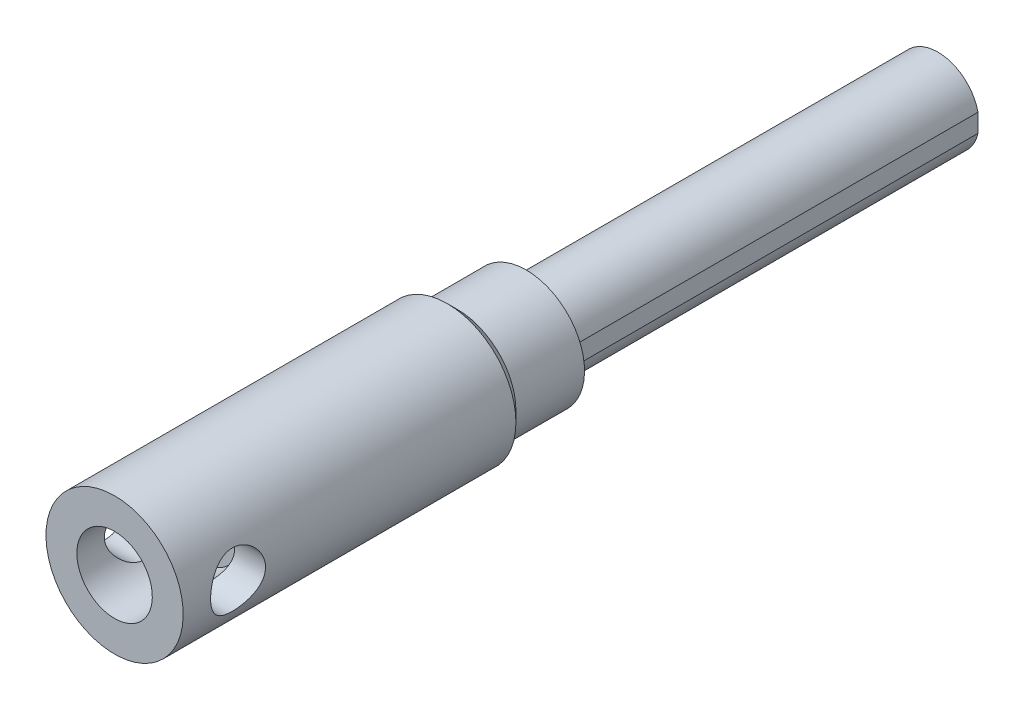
ISO-10303-21;
HEADER;
FILE_DESCRIPTION(('STEP AP214'),'2;1');
FILE_NAME('part.step','',(''),(''),'','','');
FILE_SCHEMA(('AUTOMOTIVE_DESIGN { 1 0 10303 214 1 1 1 1 }'));
ENDSEC;
DATA;
#1=APPLICATION_CONTEXT('core data for automotive mechanical design processes');
#2=APPLICATION_PROTOCOL_DEFINITION('international standard','automotive_design',2000,#1);
#3=PRODUCT_CONTEXT('',#1,'mechanical');
#4=PRODUCT('Part','Part','',(#3));
#5=PRODUCT_RELATED_PRODUCT_CATEGORY('part','',(#4));
#6=PRODUCT_DEFINITION_FORMATION('','',#4);
#7=PRODUCT_DEFINITION_CONTEXT('part definition',#1,'design');
#8=PRODUCT_DEFINITION('design','',#6,#7);
#9=PRODUCT_DEFINITION_SHAPE('','',#8);
#10=(LENGTH_UNIT() NAMED_UNIT(*) SI_UNIT(.MILLI.,.METRE.));
#11=(NAMED_UNIT(*) PLANE_ANGLE_UNIT() SI_UNIT($,.RADIAN.));
#12=(NAMED_UNIT(*) SI_UNIT($,.STERADIAN.) SOLID_ANGLE_UNIT());
#13=UNCERTAINTY_MEASURE_WITH_UNIT(LENGTH_MEASURE(1.E-05),#10,'distance_accuracy_value','');
#14=(GEOMETRIC_REPRESENTATION_CONTEXT(3) GLOBAL_UNCERTAINTY_ASSIGNED_CONTEXT((#13)) GLOBAL_UNIT_ASSIGNED_CONTEXT((#10,
#11,#12)) REPRESENTATION_CONTEXT('',''));
#15=CARTESIAN_POINT('',(0.,0.,0.));
#16=DIRECTION('',(0.,0.,1.));
#17=DIRECTION('',(1.,0.,0.));
#18=AXIS2_PLACEMENT_3D('',#15,#16,#17);
#19=CARTESIAN_POINT('',(-2.88675134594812,0.,104.));
#20=DIRECTION('',(0.866025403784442,-0.5,0.));
#21=DIRECTION('',(0.5,0.866025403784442,0.));
#22=AXIS2_PLACEMENT_3D('',#19,#20,#21);
#23=PLANE('',#22);
#24=DIRECTION('',(0.,0.,1.));
#25=VECTOR('',#24,1.);
#26=CARTESIAN_POINT('',(-1.44337567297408,2.5,104.));
#27=LINE('',#26,#25);
#28=CARTESIAN_POINT('',(-1.44337567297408,2.5,104.));
#29=VERTEX_POINT('',#28);
#30=CARTESIAN_POINT('',(-1.44337567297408,2.5,107.));
#31=VERTEX_POINT('',#30);
#32=EDGE_CURVE('E291',#29,#31,#27,.T.);
#33=ORIENTED_EDGE('',*,*,#32,.T.);
#34=DIRECTION('',(0.5,0.866025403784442,0.));
#35=VECTOR('',#34,1.);
#36=CARTESIAN_POINT('',(-2.88675134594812,0.,107.));
#37=LINE('',#36,#35);
#38=CARTESIAN_POINT('',(-2.88675134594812,0.,107.));
#39=VERTEX_POINT('',#38);
#40=EDGE_CURVE('E29',#39,#31,#37,.T.);
#41=ORIENTED_EDGE('',*,*,#40,.F.);
#42=DIRECTION('',(0.,0.,1.));
#43=VECTOR('',#42,1.);
#44=CARTESIAN_POINT('',(-2.88675134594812,0.,104.));
#45=LINE('',#44,#43);
#46=CARTESIAN_POINT('',(-2.88675134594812,0.,104.));
#47=VERTEX_POINT('',#46);
#48=EDGE_CURVE('E33',#47,#39,#45,.T.);
#49=ORIENTED_EDGE('',*,*,#48,.F.);
#50=DIRECTION('',(0.5,0.866025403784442,0.));
#51=VECTOR('',#50,1.);
#52=CARTESIAN_POINT('',(-2.88675134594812,0.,104.));
#53=LINE('',#52,#51);
#54=EDGE_CURVE('E252',#47,#29,#53,.T.);
#55=ORIENTED_EDGE('',*,*,#54,.T.);
#56=EDGE_LOOP('',(#33,#41,#49,#55));
#57=FACE_BOUND('',#56,.T.);
#58=ADVANCED_FACE('F14',(#57),#23,.T.);
#59=CARTESIAN_POINT('',(1.44337567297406,2.5,104.));
#60=DIRECTION('',(0.,1.,0.));
#61=DIRECTION('',(-1.,0.,0.));
#62=AXIS2_PLACEMENT_3D('',#59,#60,#61);
#63=PLANE('',#62);
#64=DIRECTION('',(0.,0.,1.));
#65=VECTOR('',#64,1.);
#66=CARTESIAN_POINT('',(1.44337567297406,2.5,104.));
#67=LINE('',#66,#65);
#68=CARTESIAN_POINT('',(1.44337567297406,2.5,104.));
#69=VERTEX_POINT('',#68);
#70=CARTESIAN_POINT('',(1.44337567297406,2.5,107.));
#71=VERTEX_POINT('',#70);
#72=EDGE_CURVE('E289',#69,#71,#67,.T.);
#73=ORIENTED_EDGE('',*,*,#72,.T.);
#74=DIRECTION('',(-1.,0.,0.));
#75=VECTOR('',#74,1.);
#76=CARTESIAN_POINT('',(1.44337567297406,2.5,107.));
#77=LINE('',#76,#75);
#78=EDGE_CURVE('E262',#71,#31,#77,.T.);
#79=ORIENTED_EDGE('',*,*,#78,.T.);
#80=ORIENTED_EDGE('',*,*,#32,.F.);
#81=DIRECTION('',(-1.,0.,0.));
#82=VECTOR('',#81,1.);
#83=CARTESIAN_POINT('',(1.44337567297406,2.5,104.));
#84=LINE('',#83,#82);
#85=EDGE_CURVE('E278',#69,#29,#84,.T.);
#86=ORIENTED_EDGE('',*,*,#85,.F.);
#87=EDGE_LOOP('',(#73,#79,#80,#86));
#88=FACE_BOUND('',#87,.T.);
#89=ADVANCED_FACE('F166',(#88),#63,.F.);
#90=CARTESIAN_POINT('',(2.88675134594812,0.,104.));
#91=DIRECTION('',(0.866025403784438,0.5,0.));
#92=DIRECTION('',(-0.5,0.866025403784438,0.));
#93=AXIS2_PLACEMENT_3D('',#90,#91,#92);
#94=PLANE('',#93);
#95=DIRECTION('',(0.,0.,1.));
#96=VECTOR('',#95,1.);
#97=CARTESIAN_POINT('',(2.88675134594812,0.,104.));
#98=LINE('',#97,#96);
#99=CARTESIAN_POINT('',(2.88675134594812,0.,104.));
#100=VERTEX_POINT('',#99);
#101=CARTESIAN_POINT('',(2.88675134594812,0.,107.));
#102=VERTEX_POINT('',#101);
#103=EDGE_CURVE('E287',#100,#102,#98,.T.);
#104=ORIENTED_EDGE('',*,*,#103,.T.);
#105=DIRECTION('',(-0.5,0.866025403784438,0.));
#106=VECTOR('',#105,1.);
#107=CARTESIAN_POINT('',(2.88675134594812,0.,107.));
#108=LINE('',#107,#106);
#109=EDGE_CURVE('E259',#102,#71,#108,.T.);
#110=ORIENTED_EDGE('',*,*,#109,.T.);
#111=ORIENTED_EDGE('',*,*,#72,.F.);
#112=DIRECTION('',(-0.5,0.866025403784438,0.));
#113=VECTOR('',#112,1.);
#114=CARTESIAN_POINT('',(2.88675134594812,0.,104.));
#115=LINE('',#114,#113);
#116=EDGE_CURVE('E275',#100,#69,#115,.T.);
#117=ORIENTED_EDGE('',*,*,#116,.F.);
#118=EDGE_LOOP('',(#104,#110,#111,#117));
#119=FACE_BOUND('',#118,.T.);
#120=ADVANCED_FACE('F171',(#119),#94,.F.);
#121=CARTESIAN_POINT('',(2.88675134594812,0.,104.));
#122=DIRECTION('',(-0.866025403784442,0.5,0.));
#123=DIRECTION('',(-0.5,-0.866025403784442,0.));
#124=AXIS2_PLACEMENT_3D('',#121,#122,#123);
#125=PLANE('',#124);
#126=DIRECTION('',(0.,0.,1.));
#127=VECTOR('',#126,1.);
#128=CARTESIAN_POINT('',(1.44337567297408,-2.5,104.));
#129=LINE('',#128,#127);
#130=CARTESIAN_POINT('',(1.44337567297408,-2.5,104.));
#131=VERTEX_POINT('',#130);
#132=CARTESIAN_POINT('',(1.44337567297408,-2.5,107.));
#133=VERTEX_POINT('',#132);
#134=EDGE_CURVE('E285',#131,#133,#129,.T.);
#135=ORIENTED_EDGE('',*,*,#134,.T.);
#136=DIRECTION('',(-0.5,-0.866025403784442,0.));
#137=VECTOR('',#136,1.);
#138=CARTESIAN_POINT('',(2.88675134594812,0.,107.));
#139=LINE('',#138,#137);
#140=EDGE_CURVE('E256',#102,#133,#139,.T.);
#141=ORIENTED_EDGE('',*,*,#140,.F.);
#142=ORIENTED_EDGE('',*,*,#103,.F.);
#143=DIRECTION('',(-0.5,-0.866025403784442,0.));
#144=VECTOR('',#143,1.);
#145=CARTESIAN_POINT('',(2.88675134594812,0.,104.));
#146=LINE('',#145,#144);
#147=EDGE_CURVE('E272',#100,#131,#146,.T.);
#148=ORIENTED_EDGE('',*,*,#147,.T.);
#149=EDGE_LOOP('',(#135,#141,#142,#148));
#150=FACE_BOUND('',#149,.T.);
#151=ADVANCED_FACE('F184',(#150),#125,.T.);
#152=CARTESIAN_POINT('',(-1.44337567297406,-2.5,104.));
#153=DIRECTION('',(0.,-1.,0.));
#154=DIRECTION('',(1.,0.,0.));
#155=AXIS2_PLACEMENT_3D('',#152,#153,#154);
#156=PLANE('',#155);
#157=DIRECTION('',(0.,0.,1.));
#158=VECTOR('',#157,1.);
#159=CARTESIAN_POINT('',(-1.44337567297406,-2.5,104.));
#160=LINE('',#159,#158);
#161=CARTESIAN_POINT('',(-1.44337567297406,-2.5,104.));
#162=VERTEX_POINT('',#161);
#163=CARTESIAN_POINT('',(-1.44337567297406,-2.5,107.));
#164=VERTEX_POINT('',#163);
#165=EDGE_CURVE('E283',#162,#164,#160,.T.);
#166=ORIENTED_EDGE('',*,*,#165,.T.);
#167=DIRECTION('',(1.,0.,0.));
#168=VECTOR('',#167,1.);
#169=CARTESIAN_POINT('',(-1.44337567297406,-2.5,107.));
#170=LINE('',#169,#168);
#171=EDGE_CURVE('E253',#164,#133,#170,.T.);
#172=ORIENTED_EDGE('',*,*,#171,.T.);
#173=ORIENTED_EDGE('',*,*,#134,.F.);
#174=DIRECTION('',(1.,0.,0.));
#175=VECTOR('',#174,1.);
#176=CARTESIAN_POINT('',(-1.44337567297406,-2.5,104.));
#177=LINE('',#176,#175);
#178=EDGE_CURVE('E269',#162,#131,#177,.T.);
#179=ORIENTED_EDGE('',*,*,#178,.F.);
#180=EDGE_LOOP('',(#166,#172,#173,#179));
#181=FACE_BOUND('',#180,.T.);
#182=ADVANCED_FACE('F180',(#181),#156,.F.);
#183=CARTESIAN_POINT('',(-2.88675134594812,0.,104.));
#184=DIRECTION('',(-0.866025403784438,-0.5,0.));
#185=DIRECTION('',(0.5,-0.866025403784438,0.));
#186=AXIS2_PLACEMENT_3D('',#183,#184,#185);
#187=PLANE('',#186);
#188=DIRECTION('',(0.5,-0.866025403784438,0.));
#189=VECTOR('',#188,1.);
#190=CARTESIAN_POINT('',(-2.88675134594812,0.,104.));
#191=LINE('',#190,#189);
#192=EDGE_CURVE('E266',#47,#162,#191,.T.);
#193=ORIENTED_EDGE('',*,*,#192,.F.);
#194=ORIENTED_EDGE('',*,*,#48,.T.);
#195=DIRECTION('',(0.5,-0.866025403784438,0.));
#196=VECTOR('',#195,1.);
#197=CARTESIAN_POINT('',(-2.88675134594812,0.,107.));
#198=LINE('',#197,#196);
#199=EDGE_CURVE('E249',#39,#164,#198,.T.);
#200=ORIENTED_EDGE('',*,*,#199,.T.);
#201=ORIENTED_EDGE('',*,*,#165,.F.);
#202=EDGE_LOOP('',(#193,#194,#200,#201));
#203=FACE_BOUND('',#202,.T.);
#204=ADVANCED_FACE('F177',(#203),#187,.F.);
#205=CARTESIAN_POINT('',(-1.44337567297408,2.5,104.));
#206=DIRECTION('',(0.,0.,1.));
#207=DIRECTION('',(0.,1.,0.));
#208=AXIS2_PLACEMENT_3D('',#205,#206,#207);
#209=PLANE('',#208);
#210=ORIENTED_EDGE('',*,*,#54,.F.);
#211=ORIENTED_EDGE('',*,*,#192,.T.);
#212=ORIENTED_EDGE('',*,*,#178,.T.);
#213=ORIENTED_EDGE('',*,*,#147,.F.);
#214=ORIENTED_EDGE('',*,*,#116,.T.);
#215=ORIENTED_EDGE('',*,*,#85,.T.);
#216=EDGE_LOOP('',(#210,#211,#212,#213,#214,#215));
#217=FACE_BOUND('',#216,.T.);
#218=ADVANCED_FACE('F176',(#217),#209,.T.);
#219=CARTESIAN_POINT('',(0.,0.,107.));
#220=DIRECTION('',(0.,0.,1.));
#221=DIRECTION('',(0.,1.,0.));
#222=AXIS2_PLACEMENT_3D('',#219,#220,#221);
#223=PLANE('',#222);
#224=CARTESIAN_POINT('',(0.,0.,107.));
#225=DIRECTION('',(0.,0.,1.));
#226=DIRECTION('',(0.,1.,0.));
#227=AXIS2_PLACEMENT_3D('',#224,#225,#226);
#228=CIRCLE('',#227,5.);
#229=CARTESIAN_POINT('',(0.,5.,107.));
#230=VERTEX_POINT('',#229);
#231=EDGE_CURVE('E9',#230,#230,#228,.T.);
#232=ORIENTED_EDGE('',*,*,#231,.T.);
#233=EDGE_LOOP('',(#232));
#234=FACE_BOUND('',#233,.T.);
#235=ORIENTED_EDGE('',*,*,#199,.F.);
#236=ORIENTED_EDGE('',*,*,#40,.T.);
#237=ORIENTED_EDGE('',*,*,#78,.F.);
#238=ORIENTED_EDGE('',*,*,#109,.F.);
#239=ORIENTED_EDGE('',*,*,#140,.T.);
#240=ORIENTED_EDGE('',*,*,#171,.F.);
#241=EDGE_LOOP('',(#235,#236,#237,#238,#239,#240));
#242=FACE_BOUND('',#241,.T.);
#243=ADVANCED_FACE('F16',(#234,#242),#223,.T.);
#244=CARTESIAN_POINT('',(0.,0.,91.));
#245=DIRECTION('',(0.,0.,1.));
#246=DIRECTION('',(0.,1.,0.));
#247=AXIS2_PLACEMENT_3D('',#244,#245,#246);
#248=CYLINDRICAL_SURFACE('',#247,5.);
#249=CARTESIAN_POINT('',(0.,0.,101.));
#250=DIRECTION('',(0.,0.,1.));
#251=DIRECTION('',(0.,1.,0.));
#252=AXIS2_PLACEMENT_3D('',#249,#250,#251);
#253=CIRCLE('',#252,5.);
#254=CARTESIAN_POINT('',(0.,5.,101.));
#255=VERTEX_POINT('',#254);
#256=EDGE_CURVE('E22',#255,#255,#253,.T.);
#257=ORIENTED_EDGE('',*,*,#256,.T.);
#258=EDGE_LOOP('',(#257));
#259=FACE_BOUND('',#258,.T.);
#260=ORIENTED_EDGE('',*,*,#231,.F.);
#261=EDGE_LOOP('',(#260));
#262=FACE_BOUND('',#261,.T.);
#263=ADVANCED_FACE('F191',(#259,#262),#248,.T.);
#264=CARTESIAN_POINT('',(0.,0.,0.));
#265=DIRECTION('',(0.,0.,1.));
#266=DIRECTION('',(-1.,0.,0.));
#267=AXIS2_PLACEMENT_3D('',#264,#265,#266);
#268=PLANE('',#267);
#269=DIRECTION('',(0.,-1.,0.));
#270=VECTOR('',#269,1.);
#271=CARTESIAN_POINT('',(5.85,-1.33322916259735,0.));
#272=LINE('',#271,#270);
#273=CARTESIAN_POINT('',(5.85,1.33322916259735,0.));
#274=VERTEX_POINT('',#273);
#275=CARTESIAN_POINT('',(5.85,-1.33322916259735,0.));
#276=VERTEX_POINT('',#275);
#277=EDGE_CURVE('E91',#274,#276,#272,.T.);
#278=ORIENTED_EDGE('',*,*,#277,.T.);
#279=CARTESIAN_POINT('',(0.,0.,0.));
#280=DIRECTION('',(0.,0.,1.));
#281=DIRECTION('',(-1.,0.,0.));
#282=AXIS2_PLACEMENT_3D('',#279,#280,#281);
#283=CIRCLE('',#282,6.);
#284=EDGE_CURVE('E83',#274,#276,#283,.T.);
#285=ORIENTED_EDGE('',*,*,#284,.F.);
#286=EDGE_LOOP('',(#278,#285));
#287=FACE_BOUND('',#286,.T.);
#288=ADVANCED_FACE('F95',(#287),#268,.F.);
#289=CARTESIAN_POINT('',(5.85,-1.33322916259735,80.));
#290=DIRECTION('',(1.,0.,0.));
#291=DIRECTION('',(0.,0.,1.));
#292=AXIS2_PLACEMENT_3D('',#289,#290,#291);
#293=PLANE('',#292);
#294=DIRECTION('',(0.,1.,0.));
#295=VECTOR('',#294,1.);
#296=CARTESIAN_POINT('',(5.85,8.5,60.));
#297=LINE('',#296,#295);
#298=CARTESIAN_POINT('',(5.85,-1.33322916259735,60.));
#299=VERTEX_POINT('',#298);
#300=CARTESIAN_POINT('',(5.85,1.33322916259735,60.));
#301=VERTEX_POINT('',#300);
#302=EDGE_CURVE('E246',#299,#301,#297,.T.);
#303=ORIENTED_EDGE('',*,*,#302,.F.);
#304=DIRECTION('',(0.,0.,-1.));
#305=VECTOR('',#304,1.);
#306=CARTESIAN_POINT('',(5.85,-1.33322916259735,80.));
#307=LINE('',#306,#305);
#308=EDGE_CURVE('E88',#299,#276,#307,.T.);
#309=ORIENTED_EDGE('',*,*,#308,.T.);
#310=ORIENTED_EDGE('',*,*,#277,.F.);
#311=DIRECTION('',(0.,0.,-1.));
#312=VECTOR('',#311,1.);
#313=CARTESIAN_POINT('',(5.85,1.33322916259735,80.));
#314=LINE('',#313,#312);
#315=EDGE_CURVE('E78',#301,#274,#314,.T.);
#316=ORIENTED_EDGE('',*,*,#315,.F.);
#317=EDGE_LOOP('',(#303,#309,#310,#316));
#318=FACE_BOUND('',#317,.T.);
#319=ADVANCED_FACE('F92',(#318),#293,.T.);
#320=CARTESIAN_POINT('',(0.,0.,80.));
#321=DIRECTION('',(0.,0.,-1.));
#322=DIRECTION('',(1.,0.,0.));
#323=AXIS2_PLACEMENT_3D('',#320,#321,#322);
#324=CYLINDRICAL_SURFACE('',#323,6.);
#325=ORIENTED_EDGE('',*,*,#308,.F.);
#326=CARTESIAN_POINT('',(0.,0.,60.));
#327=DIRECTION('',(0.,0.,1.));
#328=DIRECTION('',(2.05103273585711E-10,-1.,0.));
#329=AXIS2_PLACEMENT_3D('',#326,#327,#328);
#330=CIRCLE('',#329,6.);
#331=EDGE_CURVE('E84',#299,#301,#330,.F.);
#332=ORIENTED_EDGE('',*,*,#331,.T.);
#333=ORIENTED_EDGE('',*,*,#315,.T.);
#334=ORIENTED_EDGE('',*,*,#284,.T.);
#335=EDGE_LOOP('',(#325,#332,#333,#334));
#336=FACE_BOUND('',#335,.T.);
#337=ADVANCED_FACE('F81',(#336),#324,.T.);
#338=CARTESIAN_POINT('',(0.,8.5,60.));
#339=DIRECTION('',(0.,0.,1.));
#340=DIRECTION('',(0.,-1.,0.));
#341=AXIS2_PLACEMENT_3D('',#338,#339,#340);
#342=PLANE('',#341);
#343=CARTESIAN_POINT('',(0.,0.,60.));
#344=DIRECTION('',(0.,0.,-1.));
#345=DIRECTION('',(0.,1.,0.));
#346=AXIS2_PLACEMENT_3D('',#343,#344,#345);
#347=CIRCLE('',#346,8.5);
#348=CARTESIAN_POINT('',(0.,8.5,60.));
#349=VERTEX_POINT('',#348);
#350=EDGE_CURVE('E222',#349,#349,#347,.T.);
#351=ORIENTED_EDGE('',*,*,#350,.T.);
#352=EDGE_LOOP('',(#351));
#353=FACE_BOUND('',#352,.T.);
#354=ORIENTED_EDGE('',*,*,#331,.F.);
#355=ORIENTED_EDGE('',*,*,#302,.T.);
#356=EDGE_LOOP('',(#354,#355));
#357=FACE_BOUND('',#356,.T.);
#358=ADVANCED_FACE('F126',(#353,#357),#342,.F.);
#359=CARTESIAN_POINT('',(0.,0.,60.));
#360=DIRECTION('',(0.,0.,-1.));
#361=DIRECTION('',(0.,1.,0.));
#362=AXIS2_PLACEMENT_3D('',#359,#360,#361);
#363=CYLINDRICAL_SURFACE('',#362,8.5);
#364=ORIENTED_EDGE('',*,*,#350,.F.);
#365=EDGE_LOOP('',(#364));
#366=FACE_BOUND('',#365,.T.);
#367=CARTESIAN_POINT('',(0.,0.,70.));
#368=DIRECTION('',(0.,0.,-1.));
#369=DIRECTION('',(0.,1.,0.));
#370=AXIS2_PLACEMENT_3D('',#367,#368,#369);
#371=CIRCLE('',#370,8.5);
#372=CARTESIAN_POINT('',(0.,8.5,70.));
#373=VERTEX_POINT('',#372);
#374=EDGE_CURVE('E220',#373,#373,#371,.T.);
#375=ORIENTED_EDGE('',*,*,#374,.T.);
#376=EDGE_LOOP('',(#375));
#377=FACE_BOUND('',#376,.T.);
#378=ADVANCED_FACE('F151',(#366,#377),#363,.T.);
#379=CARTESIAN_POINT('',(0.,0.,70.));
#380=DIRECTION('',(0.,0.,1.));
#381=DIRECTION('',(0.,-1.,0.));
#382=AXIS2_PLACEMENT_3D('',#379,#380,#381);
#383=CONICAL_SURFACE('',#382,8.5,0.785398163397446);
#384=CARTESIAN_POINT('',(0.,0.,71.5));
#385=DIRECTION('',(0.,0.,1.));
#386=DIRECTION('',(0.,-1.,0.));
#387=AXIS2_PLACEMENT_3D('',#384,#385,#386);
#388=CIRCLE('',#387,10.);
#389=CARTESIAN_POINT('',(0.,-10.,71.5));
#390=VERTEX_POINT('',#389);
#391=EDGE_CURVE('E145',#390,#390,#388,.T.);
#392=ORIENTED_EDGE('',*,*,#391,.F.);
#393=EDGE_LOOP('',(#392));
#394=FACE_BOUND('',#393,.T.);
#395=ORIENTED_EDGE('',*,*,#374,.F.);
#396=EDGE_LOOP('',(#395));
#397=FACE_BOUND('',#396,.T.);
#398=ADVANCED_FACE('F124',(#394,#397),#383,.T.);
#399=CARTESIAN_POINT('',(0.,0.,60.));
#400=DIRECTION('',(0.,0.,-1.));
#401=DIRECTION('',(0.,1.,0.));
#402=AXIS2_PLACEMENT_3D('',#399,#400,#401);
#403=CYLINDRICAL_SURFACE('',#402,10.);
#404=ORIENTED_EDGE('',*,*,#391,.T.);
#405=EDGE_LOOP('',(#404));
#406=FACE_BOUND('',#405,.T.);
#407=CARTESIAN_POINT('',(-10.,0.,116.));
#408=CARTESIAN_POINT('',(-9.99999886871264,-0.107549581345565,115.999998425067));
#409=CARTESIAN_POINT('',(-9.99825999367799,-0.215132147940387,115.99565632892));
#410=CARTESIAN_POINT('',(-9.99134740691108,-0.429535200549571,115.978326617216));
#411=CARTESIAN_POINT('',(-9.98617152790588,-0.536355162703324,115.965333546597));
#412=CARTESIAN_POINT('',(-9.97250573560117,-0.748635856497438,115.930791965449));
#413=CARTESIAN_POINT('',(-9.96400865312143,-0.85409313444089,115.90922494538));
#414=CARTESIAN_POINT('',(-9.94393017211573,-1.06266761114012,115.857758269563));
#415=CARTESIAN_POINT('',(-9.93234752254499,-1.16578384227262,115.827855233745));
#416=CARTESIAN_POINT('',(-9.89349112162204,-1.46979509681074,115.726277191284));
#417=CARTESIAN_POINT('',(-9.86204458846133,-1.66629107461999,115.642578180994));
#418=CARTESIAN_POINT('',(-9.79113035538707,-2.04217417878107,115.44595378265));
#419=CARTESIAN_POINT('',(-9.75166544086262,-2.22156721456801,115.333038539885));
#420=CARTESIAN_POINT('',(-9.6666182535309,-2.56699339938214,115.075531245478));
#421=CARTESIAN_POINT('',(-9.62084608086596,-2.73212223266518,114.929787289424));
#422=CARTESIAN_POINT('',(-9.52921139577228,-3.03635232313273,114.613199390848));
#423=CARTESIAN_POINT('',(-9.48334885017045,-3.17544084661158,114.442343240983));
#424=CARTESIAN_POINT('',(-9.39445587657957,-3.42974847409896,114.071144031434));
#425=CARTESIAN_POINT('',(-9.35164233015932,-3.54362978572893,113.869827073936));
#426=CARTESIAN_POINT('',(-9.27667293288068,-3.73550961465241,113.448927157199));
#427=CARTESIAN_POINT('',(-9.24451202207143,-3.81352517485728,113.229352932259));
#428=CARTESIAN_POINT('',(-9.19652715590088,-3.92779760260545,112.788575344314));
#429=CARTESIAN_POINT('',(-9.18002840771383,-3.96578791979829,112.567897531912));
#430=CARTESIAN_POINT('',(-9.1632800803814,-4.00434593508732,112.122730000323));
#431=CARTESIAN_POINT('',(-9.163022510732,-4.00493203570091,111.898242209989));
#432=CARTESIAN_POINT('',(-9.178210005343,-3.96997873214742,111.468486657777));
#433=CARTESIAN_POINT('',(-9.19256349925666,-3.93695062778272,111.262968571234));
#434=CARTESIAN_POINT('',(-9.23352375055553,-3.83989376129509,110.86068088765));
#435=CARTESIAN_POINT('',(-9.2601326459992,-3.77585958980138,110.663912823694));
#436=CARTESIAN_POINT('',(-9.32318970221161,-3.61738946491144,110.279964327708));
#437=CARTESIAN_POINT('',(-9.35982758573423,-3.5223597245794,110.093061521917));
#438=CARTESIAN_POINT('',(-9.43876232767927,-3.3050129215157,109.73716836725));
#439=CARTESIAN_POINT('',(-9.48106130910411,-3.18268561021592,109.568184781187));
#440=CARTESIAN_POINT('',(-9.5705347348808,-2.90310119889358,109.239180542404));
#441=CARTESIAN_POINT('',(-9.61783329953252,-2.74387492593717,109.08086254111));
#442=CARTESIAN_POINT('',(-9.70919649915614,-2.4006288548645,108.792631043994));
#443=CARTESIAN_POINT('',(-9.75326048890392,-2.21660413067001,108.662723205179));
#444=CARTESIAN_POINT('',(-9.83429362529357,-1.82415530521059,108.432765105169));
#445=CARTESIAN_POINT('',(-9.87110540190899,-1.61532098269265,108.333355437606));
#446=CARTESIAN_POINT('',(-9.93229656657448,-1.18204753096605,108.171664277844));
#447=CARTESIAN_POINT('',(-9.95668226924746,-0.957616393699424,108.109363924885));
#448=CARTESIAN_POINT('',(-9.98912279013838,-0.513791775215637,108.027103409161));
#449=CARTESIAN_POINT('',(-9.99805891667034,-0.294886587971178,108.004855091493));
#450=CARTESIAN_POINT('',(-10.0013695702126,0.143690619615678,107.996573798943));
#451=CARTESIAN_POINT('',(-9.99574787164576,0.363362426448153,108.010531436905));
#452=CARTESIAN_POINT('',(-9.97115134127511,0.786865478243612,108.072583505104));
#453=CARTESIAN_POINT('',(-9.95278782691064,0.990964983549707,108.119115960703));
#454=CARTESIAN_POINT('',(-9.90518882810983,1.38827085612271,108.242871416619));
#455=CARTESIAN_POINT('',(-9.87595194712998,1.5814758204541,108.320098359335));
#456=CARTESIAN_POINT('',(-9.80833189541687,1.95815757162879,108.505569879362));
#457=CARTESIAN_POINT('',(-9.76969631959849,2.14115604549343,108.614690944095));
#458=CARTESIAN_POINT('',(-9.68746729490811,2.4868871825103,108.859880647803));
#459=CARTESIAN_POINT('',(-9.64387186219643,2.64961168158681,108.995960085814));
#460=CARTESIAN_POINT('',(-9.55290235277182,2.96144608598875,109.301740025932));
#461=CARTESIAN_POINT('',(-9.5054688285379,3.10894786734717,109.473067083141));
#462=CARTESIAN_POINT('',(-9.41483345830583,3.37350239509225,109.83888016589));
#463=CARTESIAN_POINT('',(-9.37163231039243,3.49055012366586,110.033370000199));
#464=CARTESIAN_POINT('',(-9.2942859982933,3.69161500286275,110.442923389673));
#465=CARTESIAN_POINT('',(-9.26023261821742,3.77530118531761,110.658168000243));
#466=CARTESIAN_POINT('',(-9.20647346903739,3.90459244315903,111.101467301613));
#467=CARTESIAN_POINT('',(-9.18675711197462,3.95022562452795,111.329512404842));
#468=CARTESIAN_POINT('',(-9.1654351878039,3.99943122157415,111.774255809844));
#469=CARTESIAN_POINT('',(-9.16262842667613,4.00579411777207,111.990589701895));
#470=CARTESIAN_POINT('',(-9.1722967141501,3.98360636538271,112.421089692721));
#471=CARTESIAN_POINT('',(-9.18476982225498,3.95506015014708,112.635256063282));
#472=CARTESIAN_POINT('',(-9.22253300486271,3.86614256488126,113.04666446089));
#473=CARTESIAN_POINT('',(-9.24729672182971,3.80707437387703,113.244240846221));
#474=CARTESIAN_POINT('',(-9.30647993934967,3.66001151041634,113.62675696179));
#475=CARTESIAN_POINT('',(-9.34090210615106,3.57200884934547,113.811693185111));
#476=CARTESIAN_POINT('',(-9.41797252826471,3.36374310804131,114.175220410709));
#477=CARTESIAN_POINT('',(-9.46097893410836,3.24192140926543,114.352841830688));
#478=CARTESIAN_POINT('',(-9.54927479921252,2.97179350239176,114.685982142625));
#479=CARTESIAN_POINT('',(-9.59456494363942,2.82347931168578,114.84149434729));
#480=CARTESIAN_POINT('',(-9.68587647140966,2.49297412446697,115.136423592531));
#481=CARTESIAN_POINT('',(-9.73175488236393,2.30921017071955,115.274143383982));
#482=CARTESIAN_POINT('',(-9.7949502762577,2.01716584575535,115.456048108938));
#483=CARTESIAN_POINT('',(-9.81509269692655,1.91699501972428,115.512607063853));
#484=CARTESIAN_POINT('',(-9.85294835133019,1.7118011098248,115.617037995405));
#485=CARTESIAN_POINT('',(-9.87066269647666,1.60678027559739,115.664913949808));
#486=CARTESIAN_POINT('',(-9.9028559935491,1.39454646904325,115.750747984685));
#487=CARTESIAN_POINT('',(-9.91738778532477,1.28740777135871,115.788870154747));
#488=CARTESIAN_POINT('',(-9.94319722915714,1.06995577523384,115.855921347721));
#489=CARTESIAN_POINT('',(-9.95447639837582,0.95964398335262,115.88485465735));
#490=CARTESIAN_POINT('',(-9.97343330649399,0.736945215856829,115.933174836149));
#491=CARTESIAN_POINT('',(-9.98112017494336,0.624564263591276,115.952585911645));
#492=CARTESIAN_POINT('',(-9.99270031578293,0.398419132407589,115.981738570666));
#493=CARTESIAN_POINT('',(-9.99659628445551,0.284655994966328,115.991487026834));
#494=CARTESIAN_POINT('',(-9.99951445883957,0.113830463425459,115.998785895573));
#495=CARTESIAN_POINT('',(-10.0000005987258,0.0569198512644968,116.000000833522));
#496=CARTESIAN_POINT('',(-10.,0.,116.));
#497=B_SPLINE_CURVE_WITH_KNOTS('',3,(#407,#408,#409,#410,#411,#412,#413,#414,#415,#416,#417,
#418,#419,#420,#421,#422,#423,#424,#425,#426,#427,#428,#429,#430,#431,#432,#433,#434,#435,#436,
#437,#438,#439,#440,#441,#442,#443,#444,#445,#446,#447,#448,#449,#450,#451,#452,#453,#454,#455,
#456,#457,#458,#459,#460,#461,#462,#463,#464,#465,#466,#467,#468,#469,#470,#471,#472,#473,#474,
#475,#476,#477,#478,#479,#480,#481,#482,#483,#484,#485,#486,#487,#488,#489,#490,#491,#492,#493,
#494,#495,#496),.UNSPECIFIED.,.T.,.F.,(4,2,2,2,2,2,2,2,2,2,2,2,2,2,2,2,2,2,2,2,2,2,2,2,2,2,2,2,
2,2,2,2,2,2,2,2,2,2,2,2,2,2,2,2,4),(0.,0.322603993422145,0.64541160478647,0.968919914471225,
1.29255959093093,1.93701523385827,2.58124739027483,3.25313995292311,3.92536021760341,
4.62749749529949,5.32930078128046,5.99927442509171,6.66891844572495,7.29195888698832,
7.91510806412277,8.55097484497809,9.18708075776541,9.87235930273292,10.5577741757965,
11.2567305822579,11.9553314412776,12.6125760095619,13.2696501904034,13.8972014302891,
14.5248332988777,15.171662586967,15.8187515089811,16.50856181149,17.1984856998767,
17.8950932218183,18.5911857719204,19.2371857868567,19.8831037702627,20.5034786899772,
21.124025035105,21.7801016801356,22.4363763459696,23.1352007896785,23.4851924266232,
23.8350233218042,24.1785111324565,24.52183846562,24.8642884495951,25.2064946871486,
25.3772305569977),.UNSPECIFIED.);
#498=CARTESIAN_POINT('',(-10.,0.,116.));
#499=VERTEX_POINT('',#498);
#500=EDGE_CURVE('E139',#499,#499,#497,.T.);
#501=ORIENTED_EDGE('',*,*,#500,.T.);
#502=EDGE_LOOP('',(#501));
#503=FACE_BOUND('',#502,.T.);
#504=CARTESIAN_POINT('',(10.,0.,116.));
#505=CARTESIAN_POINT('',(9.99999886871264,0.107549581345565,115.999998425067));
#506=CARTESIAN_POINT('',(9.99825999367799,0.215132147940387,115.99565632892));
#507=CARTESIAN_POINT('',(9.99134740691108,0.429535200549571,115.978326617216));
#508=CARTESIAN_POINT('',(9.98617152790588,0.536355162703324,115.965333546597));
#509=CARTESIAN_POINT('',(9.97250573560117,0.748635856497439,115.930791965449));
#510=CARTESIAN_POINT('',(9.96400865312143,0.854093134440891,115.90922494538));
#511=CARTESIAN_POINT('',(9.94393017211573,1.06266761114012,115.857758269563));
#512=CARTESIAN_POINT('',(9.93234752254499,1.16578384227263,115.827855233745));
#513=CARTESIAN_POINT('',(9.89349112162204,1.46979509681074,115.726277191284));
#514=CARTESIAN_POINT('',(9.86204458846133,1.66629107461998,115.642578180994));
#515=CARTESIAN_POINT('',(9.79113035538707,2.04217417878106,115.44595378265));
#516=CARTESIAN_POINT('',(9.75166544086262,2.22156721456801,115.333038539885));
#517=CARTESIAN_POINT('',(9.6666182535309,2.56699339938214,115.075531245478));
#518=CARTESIAN_POINT('',(9.62084608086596,2.73212223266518,114.929787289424));
#519=CARTESIAN_POINT('',(9.52921139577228,3.03635232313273,114.613199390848));
#520=CARTESIAN_POINT('',(9.48334885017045,3.17544084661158,114.442343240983));
#521=CARTESIAN_POINT('',(9.39445587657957,3.42974847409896,114.071144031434));
#522=CARTESIAN_POINT('',(9.35164233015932,3.54362978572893,113.869827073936));
#523=CARTESIAN_POINT('',(9.27667293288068,3.73550961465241,113.448927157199));
#524=CARTESIAN_POINT('',(9.24451202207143,3.81352517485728,113.229352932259));
#525=CARTESIAN_POINT('',(9.19652715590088,3.92779760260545,112.788575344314));
#526=CARTESIAN_POINT('',(9.18002840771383,3.9657879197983,112.567897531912));
#527=CARTESIAN_POINT('',(9.1632800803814,4.00434593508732,112.122730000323));
#528=CARTESIAN_POINT('',(9.163022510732,4.00493203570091,111.898242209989));
#529=CARTESIAN_POINT('',(9.178210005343,3.96997873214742,111.468486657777));
#530=CARTESIAN_POINT('',(9.19256349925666,3.93695062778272,111.262968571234));
#531=CARTESIAN_POINT('',(9.23352375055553,3.83989376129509,110.86068088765));
#532=CARTESIAN_POINT('',(9.2601326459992,3.77585958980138,110.663912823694));
#533=CARTESIAN_POINT('',(9.32318970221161,3.61738946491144,110.279964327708));
#534=CARTESIAN_POINT('',(9.35982758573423,3.5223597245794,110.093061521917));
#535=CARTESIAN_POINT('',(9.43876232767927,3.3050129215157,109.73716836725));
#536=CARTESIAN_POINT('',(9.48106130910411,3.18268561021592,109.568184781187));
#537=CARTESIAN_POINT('',(9.5705347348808,2.90310119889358,109.239180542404));
#538=CARTESIAN_POINT('',(9.61783329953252,2.74387492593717,109.08086254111));
#539=CARTESIAN_POINT('',(9.70919649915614,2.4006288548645,108.792631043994));
#540=CARTESIAN_POINT('',(9.75326048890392,2.21660413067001,108.662723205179));
#541=CARTESIAN_POINT('',(9.83429362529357,1.82415530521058,108.432765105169));
#542=CARTESIAN_POINT('',(9.87110540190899,1.61532098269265,108.333355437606));
#543=CARTESIAN_POINT('',(9.93229656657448,1.18204753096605,108.171664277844));
#544=CARTESIAN_POINT('',(9.95668226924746,0.957616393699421,108.109363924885));
#545=CARTESIAN_POINT('',(9.98912279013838,0.513791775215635,108.027103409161));
#546=CARTESIAN_POINT('',(9.99805891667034,0.294886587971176,108.004855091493));
#547=CARTESIAN_POINT('',(10.0013695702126,-0.143690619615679,107.996573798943));
#548=CARTESIAN_POINT('',(9.99574787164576,-0.363362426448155,108.010531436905));
#549=CARTESIAN_POINT('',(9.97115134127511,-0.786865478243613,108.072583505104));
#550=CARTESIAN_POINT('',(9.95278782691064,-0.990964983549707,108.119115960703));
#551=CARTESIAN_POINT('',(9.90518882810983,-1.38827085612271,108.242871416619));
#552=CARTESIAN_POINT('',(9.87595194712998,-1.5814758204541,108.320098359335));
#553=CARTESIAN_POINT('',(9.80833189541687,-1.95815757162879,108.505569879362));
#554=CARTESIAN_POINT('',(9.76969631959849,-2.14115604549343,108.614690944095));
#555=CARTESIAN_POINT('',(9.68746729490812,-2.4868871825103,108.859880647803));
#556=CARTESIAN_POINT('',(9.64387186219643,-2.64961168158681,108.995960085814));
#557=CARTESIAN_POINT('',(9.55290235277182,-2.96144608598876,109.301740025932));
#558=CARTESIAN_POINT('',(9.5054688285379,-3.10894786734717,109.473067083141));
#559=CARTESIAN_POINT('',(9.41483345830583,-3.37350239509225,109.83888016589));
#560=CARTESIAN_POINT('',(9.37163231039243,-3.49055012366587,110.033370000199));
#561=CARTESIAN_POINT('',(9.2942859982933,-3.69161500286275,110.442923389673));
#562=CARTESIAN_POINT('',(9.26023261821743,-3.77530118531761,110.658168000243));
#563=CARTESIAN_POINT('',(9.20647346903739,-3.90459244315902,111.101467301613));
#564=CARTESIAN_POINT('',(9.18675711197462,-3.95022562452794,111.329512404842));
#565=CARTESIAN_POINT('',(9.1654351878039,-3.99943122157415,111.774255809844));
#566=CARTESIAN_POINT('',(9.16262842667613,-4.00579411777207,111.990589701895));
#567=CARTESIAN_POINT('',(9.1722967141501,-3.98360636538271,112.421089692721));
#568=CARTESIAN_POINT('',(9.18476982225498,-3.95506015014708,112.635256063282));
#569=CARTESIAN_POINT('',(9.22253300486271,-3.86614256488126,113.04666446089));
#570=CARTESIAN_POINT('',(9.24729672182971,-3.80707437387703,113.244240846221));
#571=CARTESIAN_POINT('',(9.30647993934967,-3.66001151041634,113.62675696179));
#572=CARTESIAN_POINT('',(9.34090210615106,-3.57200884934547,113.811693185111));
#573=CARTESIAN_POINT('',(9.41797252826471,-3.36374310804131,114.175220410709));
#574=CARTESIAN_POINT('',(9.46097893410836,-3.24192140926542,114.352841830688));
#575=CARTESIAN_POINT('',(9.54927479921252,-2.97179350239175,114.685982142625));
#576=CARTESIAN_POINT('',(9.59456494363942,-2.82347931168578,114.84149434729));
#577=CARTESIAN_POINT('',(9.68587647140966,-2.49297412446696,115.136423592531));
#578=CARTESIAN_POINT('',(9.73175488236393,-2.30921017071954,115.274143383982));
#579=CARTESIAN_POINT('',(9.7949502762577,-2.01716584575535,115.456048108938));
#580=CARTESIAN_POINT('',(9.81509269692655,-1.91699501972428,115.512607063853));
#581=CARTESIAN_POINT('',(9.85294835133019,-1.71180110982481,115.617037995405));
#582=CARTESIAN_POINT('',(9.87066269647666,-1.60678027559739,115.664913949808));
#583=CARTESIAN_POINT('',(9.9028559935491,-1.39454646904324,115.750747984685));
#584=CARTESIAN_POINT('',(9.91738778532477,-1.28740777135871,115.788870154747));
#585=CARTESIAN_POINT('',(9.94319722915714,-1.06995577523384,115.855921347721));
#586=CARTESIAN_POINT('',(9.95447639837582,-0.959643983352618,115.88485465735));
#587=CARTESIAN_POINT('',(9.97343330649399,-0.736945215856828,115.933174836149));
#588=CARTESIAN_POINT('',(9.98112017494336,-0.624564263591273,115.952585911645));
#589=CARTESIAN_POINT('',(9.99270031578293,-0.398419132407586,115.981738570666));
#590=CARTESIAN_POINT('',(9.99659628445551,-0.284655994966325,115.991487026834));
#591=CARTESIAN_POINT('',(9.99951445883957,-0.113830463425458,115.998785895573));
#592=CARTESIAN_POINT('',(10.0000005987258,-0.0569198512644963,116.000000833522));
#593=CARTESIAN_POINT('',(10.,0.,116.));
#594=B_SPLINE_CURVE_WITH_KNOTS('',3,(#504,#505,#506,#507,#508,#509,#510,#511,#512,#513,#514,
#515,#516,#517,#518,#519,#520,#521,#522,#523,#524,#525,#526,#527,#528,#529,#530,#531,#532,#533,
#534,#535,#536,#537,#538,#539,#540,#541,#542,#543,#544,#545,#546,#547,#548,#549,#550,#551,#552,
#553,#554,#555,#556,#557,#558,#559,#560,#561,#562,#563,#564,#565,#566,#567,#568,#569,#570,#571,
#572,#573,#574,#575,#576,#577,#578,#579,#580,#581,#582,#583,#584,#585,#586,#587,#588,#589,#590,
#591,#592,#593),.UNSPECIFIED.,.T.,.F.,(4,2,2,2,2,2,2,2,2,2,2,2,2,2,2,2,2,2,2,2,2,2,2,2,2,2,2,2,
2,2,2,2,2,2,2,2,2,2,2,2,2,2,2,2,4),(0.,0.322603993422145,0.645411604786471,0.968919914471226,
1.29255959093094,1.93701523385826,2.58124739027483,3.25313995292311,3.92536021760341,
4.62749749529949,5.32930078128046,5.99927442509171,6.66891844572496,7.29195888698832,
7.91510806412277,8.55097484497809,9.18708075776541,9.87235930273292,10.5577741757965,
11.2567305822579,11.9553314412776,12.6125760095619,13.2696501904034,13.8972014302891,
14.5248332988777,15.171662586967,15.8187515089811,16.50856181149,17.1984856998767,
17.8950932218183,18.5911857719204,19.2371857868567,19.8831037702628,20.5034786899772,
21.124025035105,21.7801016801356,22.4363763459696,23.1352007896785,23.4851924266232,
23.8350233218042,24.1785111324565,24.52183846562,24.8642884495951,25.2064946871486,
25.3772305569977),.UNSPECIFIED.);
#595=CARTESIAN_POINT('',(10.,0.,116.));
#596=VERTEX_POINT('',#595);
#597=EDGE_CURVE('E131',#596,#596,#594,.T.);
#598=ORIENTED_EDGE('',*,*,#597,.T.);
#599=EDGE_LOOP('',(#598));
#600=FACE_BOUND('',#599,.T.);
#601=CARTESIAN_POINT('',(0.,0.,120.));
#602=DIRECTION('',(0.,0.,-1.));
#603=DIRECTION('',(0.,1.,0.));
#604=AXIS2_PLACEMENT_3D('',#601,#602,#603);
#605=CIRCLE('',#604,10.);
#606=CARTESIAN_POINT('',(0.,10.,120.));
#607=VERTEX_POINT('',#606);
#608=EDGE_CURVE('E215',#607,#607,#605,.T.);
#609=ORIENTED_EDGE('',*,*,#608,.T.);
#610=EDGE_LOOP('',(#609));
#611=FACE_BOUND('',#610,.T.);
#612=ADVANCED_FACE('F123',(#406,#503,#600,#611),#403,.T.);
#613=CARTESIAN_POINT('',(0.,10.,120.));
#614=DIRECTION('',(0.,0.,-1.));
#615=DIRECTION('',(0.,1.,0.));
#616=AXIS2_PLACEMENT_3D('',#613,#614,#615);
#617=PLANE('',#616);
#618=ORIENTED_EDGE('',*,*,#608,.F.);
#619=EDGE_LOOP('',(#618));
#620=FACE_BOUND('',#619,.T.);
#621=CARTESIAN_POINT('',(0.,0.,120.));
#622=DIRECTION('',(0.,0.,-1.));
#623=DIRECTION('',(0.,1.,0.));
#624=AXIS2_PLACEMENT_3D('',#621,#622,#623);
#625=CIRCLE('',#624,5.5);
#626=CARTESIAN_POINT('',(0.,5.5,120.));
#627=VERTEX_POINT('',#626);
#628=EDGE_CURVE('E212',#627,#627,#625,.T.);
#629=ORIENTED_EDGE('',*,*,#628,.T.);
#630=EDGE_LOOP('',(#629));
#631=FACE_BOUND('',#630,.T.);
#632=ADVANCED_FACE('F149',(#620,#631),#617,.F.);
#633=CARTESIAN_POINT('',(-10.,0.,112.));
#634=DIRECTION('',(1.,0.,0.));
#635=DIRECTION('',(0.,0.,1.));
#636=AXIS2_PLACEMENT_3D('',#633,#634,#635);
#637=CYLINDRICAL_SURFACE('',#636,4.);
#638=ORIENTED_EDGE('',*,*,#597,.F.);
#639=EDGE_LOOP('',(#638));
#640=FACE_BOUND('',#639,.T.);
#641=CARTESIAN_POINT('',(5.5,0.,116.));
#642=CARTESIAN_POINT('',(5.49999903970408,-0.0984084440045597,115.999998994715));
#643=CARTESIAN_POINT('',(5.49735205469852,-0.196846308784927,115.996361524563));
#644=CARTESIAN_POINT('',(5.48682476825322,-0.39294987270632,115.981867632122));
#645=CARTESIAN_POINT('',(5.47894116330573,-0.490615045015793,115.971006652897));
#646=CARTESIAN_POINT('',(5.45810479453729,-0.684555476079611,115.942208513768));
#647=CARTESIAN_POINT('',(5.44514186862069,-0.780827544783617,115.92425716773));
#648=CARTESIAN_POINT('',(5.41445183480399,-0.971092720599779,115.881559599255));
#649=CARTESIAN_POINT('',(5.39672260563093,-1.06508479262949,115.856810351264));
#650=CARTESIAN_POINT('',(5.33719436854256,-1.34149727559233,115.773221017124));
#651=CARTESIAN_POINT('',(5.28889729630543,-1.51974308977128,115.704826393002));
#652=CARTESIAN_POINT('',(5.17868357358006,-1.86104833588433,115.54570801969));
#653=CARTESIAN_POINT('',(5.11677145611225,-2.02411279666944,115.454991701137));
#654=CARTESIAN_POINT('',(4.97726899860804,-2.3474519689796,115.244986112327));
#655=CARTESIAN_POINT('',(4.89876490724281,-2.50612448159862,115.123848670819));
#656=CARTESIAN_POINT('',(4.73555684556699,-2.80234464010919,114.861145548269));
#657=CARTESIAN_POINT('',(4.65084317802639,-2.93985815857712,114.719547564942));
#658=CARTESIAN_POINT('',(4.51549142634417,-3.14142944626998,114.478940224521));
#659=CARTESIAN_POINT('',(4.46491683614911,-3.21271520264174,114.385843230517));
#660=CARTESIAN_POINT('',(4.36503158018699,-3.34716368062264,114.193238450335));
#661=CARTESIAN_POINT('',(4.31572127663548,-3.41032409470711,114.093728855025));
#662=CARTESIAN_POINT('',(4.2200230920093,-3.52805237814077,113.888598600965));
#663=CARTESIAN_POINT('',(4.1736313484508,-3.58263175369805,113.782986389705));
#664=CARTESIAN_POINT('',(4.08554066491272,-3.68277103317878,113.565733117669));
#665=CARTESIAN_POINT('',(4.04384093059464,-3.72833246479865,113.454093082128));
#666=CARTESIAN_POINT('',(3.95419172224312,-3.82361059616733,113.185949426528));
#667=CARTESIAN_POINT('',(3.90893007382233,-3.86948259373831,113.02708689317));
#668=CARTESIAN_POINT('',(3.85440723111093,-3.92354368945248,112.78279639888));
#669=CARTESIAN_POINT('',(3.83846627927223,-3.93910176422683,112.700413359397));
#670=CARTESIAN_POINT('',(3.81162335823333,-3.96508247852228,112.534038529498));
#671=CARTESIAN_POINT('',(3.80071933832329,-3.97550720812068,112.450047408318));
#672=CARTESIAN_POINT('',(3.78436723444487,-3.99107685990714,112.280389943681));
#673=CARTESIAN_POINT('',(3.77896160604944,-3.99618070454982,112.194715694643));
#674=CARTESIAN_POINT('',(3.77401268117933,-4.00085496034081,112.023046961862));
#675=CARTESIAN_POINT('',(3.77446917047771,-4.00042557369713,111.937052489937));
#676=CARTESIAN_POINT('',(3.78122375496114,-3.99404153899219,111.765465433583));
#677=CARTESIAN_POINT('',(3.7875243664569,-3.98808451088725,111.679873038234));
#678=CARTESIAN_POINT('',(3.80567208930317,-3.97077015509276,111.50979837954));
#679=CARTESIAN_POINT('',(3.81752207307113,-3.95941003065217,111.42531671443));
#680=CARTESIAN_POINT('',(3.847898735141,-3.92990735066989,111.248498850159));
#681=CARTESIAN_POINT('',(3.86703500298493,-3.91113665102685,111.156372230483));
#682=CARTESIAN_POINT('',(3.91064916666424,-3.86752833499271,110.97483911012));
#683=CARTESIAN_POINT('',(3.93513064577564,-3.8426866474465,110.885434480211));
#684=CARTESIAN_POINT('',(4.01518937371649,-3.75954096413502,110.621647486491));
#685=CARTESIAN_POINT('',(4.07734524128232,-3.69264874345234,110.451879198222));
#686=CARTESIAN_POINT('',(4.18940076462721,-3.56421234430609,110.180408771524));
#687=CARTESIAN_POINT('',(4.23654386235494,-3.50823146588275,110.074782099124));
#688=CARTESIAN_POINT('',(4.33354849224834,-3.387674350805,109.869791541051));
#689=CARTESIAN_POINT('',(4.38341075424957,-3.32309579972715,109.770429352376));
#690=CARTESIAN_POINT('',(4.48428947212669,-3.18565928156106,109.578107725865));
#691=CARTESIAN_POINT('',(4.53530686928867,-3.11279435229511,109.485153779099));
#692=CARTESIAN_POINT('',(4.63707579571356,-2.95905843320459,109.30594962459));
#693=CARTESIAN_POINT('',(4.68782731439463,-2.87818712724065,109.2196996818));
#694=CARTESIAN_POINT('',(4.78843347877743,-2.70755212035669,109.053213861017));
#695=CARTESIAN_POINT('',(4.83826850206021,-2.61768838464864,108.973068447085));
#696=CARTESIAN_POINT('',(4.93511583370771,-2.430178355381,108.820560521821));
#697=CARTESIAN_POINT('',(4.98212852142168,-2.33253311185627,108.748196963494));
#698=CARTESIAN_POINT('',(5.07204693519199,-2.12992764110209,108.612040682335));
#699=CARTESIAN_POINT('',(5.11496000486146,-2.02498109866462,108.548232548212));
#700=CARTESIAN_POINT('',(5.19556941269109,-1.80816162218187,108.429871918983));
#701=CARTESIAN_POINT('',(5.23326771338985,-1.69629131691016,108.375315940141));
#702=CARTESIAN_POINT('',(5.31912327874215,-1.4102171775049,108.252217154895));
#703=CARTESIAN_POINT('',(5.36345823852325,-1.23214464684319,108.189764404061));
#704=CARTESIAN_POINT('',(5.43463079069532,-0.865776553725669,108.09021443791));
#705=CARTESIAN_POINT('',(5.46148127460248,-0.677488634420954,108.053098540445));
#706=CARTESIAN_POINT('',(5.49544580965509,-0.295007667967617,108.006230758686));
#707=CARTESIAN_POINT('',(5.50248769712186,-0.100795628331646,107.996578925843));
#708=CARTESIAN_POINT('',(5.49594258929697,0.28662144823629,108.005579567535));
#709=CARTESIAN_POINT('',(5.48235470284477,0.479826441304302,108.024233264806));
#710=CARTESIAN_POINT('',(5.43715890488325,0.848454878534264,108.086800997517));
#711=CARTESIAN_POINT('',(5.40660857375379,1.02426702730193,108.129233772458));
#712=CARTESIAN_POINT('',(5.33063562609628,1.36562564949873,108.236081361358));
#713=CARTESIAN_POINT('',(5.2852099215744,1.53116998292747,108.300500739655));
#714=CARTESIAN_POINT('',(5.17819647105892,1.86254817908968,108.454991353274));
#715=CARTESIAN_POINT('',(5.11557595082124,2.02725211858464,108.54675530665));
#716=CARTESIAN_POINT('',(4.98054847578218,2.33947109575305,108.750131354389));
#717=CARTESIAN_POINT('',(4.90813499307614,2.48697454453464,108.861756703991));
#718=CARTESIAN_POINT('',(4.74403863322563,2.78904311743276,109.124527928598));
#719=CARTESIAN_POINT('',(4.65125321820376,2.93996918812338,109.279168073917));
#720=CARTESIAN_POINT('',(4.46542541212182,3.21520511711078,109.610662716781));
#721=CARTESIAN_POINT('',(4.37238287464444,3.33949353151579,109.787534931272));
#722=CARTESIAN_POINT('',(4.2058681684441,3.54628148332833,110.13977727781));
#723=CARTESIAN_POINT('',(4.13138834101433,3.63201008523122,110.312766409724));
#724=CARTESIAN_POINT('',(3.99745252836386,3.77892413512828,110.674252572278));
#725=CARTESIAN_POINT('',(3.93796522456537,3.8401609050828,110.86271616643));
#726=CARTESIAN_POINT('',(3.85373689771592,3.9244744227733,111.210546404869));
#727=CARTESIAN_POINT('',(3.82427115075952,3.95293016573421,111.367433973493));
#728=CARTESIAN_POINT('',(3.7846936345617,3.99085072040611,111.685810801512));
#729=CARTESIAN_POINT('',(3.77455417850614,4.00034270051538,111.84729314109));
#730=CARTESIAN_POINT('',(3.77530099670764,3.99963772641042,112.170405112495));
#731=CARTESIAN_POINT('',(3.78621865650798,3.98941138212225,112.33203460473));
#732=CARTESIAN_POINT('',(3.82728792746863,3.95001664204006,112.650555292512));
#733=CARTESIAN_POINT('',(3.85746988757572,3.9208183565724,112.807438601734));
#734=CARTESIAN_POINT('',(3.94430870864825,3.83369579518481,113.15974890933));
#735=CARTESIAN_POINT('',(4.00623096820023,3.76972865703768,113.352350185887));
#736=CARTESIAN_POINT('',(4.14523984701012,3.6163070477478,113.721161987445));
#737=CARTESIAN_POINT('',(4.22235196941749,3.52680959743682,113.897344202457));
#738=CARTESIAN_POINT('',(4.38556998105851,3.32181769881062,114.237427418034));
#739=CARTESIAN_POINT('',(4.4718734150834,3.20563731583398,114.40081617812));
#740=CARTESIAN_POINT('',(4.64440662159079,2.95012732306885,114.708641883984));
#741=CARTESIAN_POINT('',(4.73063634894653,2.81078817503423,114.853070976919));
#742=CARTESIAN_POINT('',(4.86434742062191,2.56887263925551,115.068537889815));
#743=CARTESIAN_POINT('',(4.91380339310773,2.47320695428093,115.146200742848));
#744=CARTESIAN_POINT('',(5.00915341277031,2.27388986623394,115.293137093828));
#745=CARTESIAN_POINT('',(5.05504665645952,2.17023667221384,115.362408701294));
#746=CARTESIAN_POINT('',(5.14192851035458,1.95549931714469,115.491663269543));
#747=CARTESIAN_POINT('',(5.18292195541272,1.84442265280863,115.551655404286));
#748=CARTESIAN_POINT('',(5.25880189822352,1.61540436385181,115.661499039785));
#749=CARTESIAN_POINT('',(5.29369157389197,1.49746635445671,115.711355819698));
#750=CARTESIAN_POINT('',(5.34730754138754,1.2900757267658,115.787373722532));
#751=CARTESIAN_POINT('',(5.3678085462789,1.20206275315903,115.816241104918));
#752=CARTESIAN_POINT('',(5.40470593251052,1.02345557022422,115.867967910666));
#753=CARTESIAN_POINT('',(5.42110328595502,0.932861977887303,115.890828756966));
#754=CARTESIAN_POINT('',(5.44942698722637,0.749865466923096,115.93019600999));
#755=CARTESIAN_POINT('',(5.46136464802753,0.657467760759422,115.946718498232));
#756=CARTESIAN_POINT('',(5.48056812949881,0.471295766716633,115.973249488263));
#757=CARTESIAN_POINT('',(5.48783649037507,0.377522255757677,115.98326153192));
#758=CARTESIAN_POINT('',(5.49512453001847,0.23629670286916,115.993294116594));
#759=CARTESIAN_POINT('',(5.49695146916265,0.189097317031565,115.995807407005));
#760=CARTESIAN_POINT('',(5.4993895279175,0.0946008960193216,115.999160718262));
#761=CARTESIAN_POINT('',(5.50000046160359,0.0473038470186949,116.000000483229));
#762=CARTESIAN_POINT('',(5.5,0.,116.));
#763=B_SPLINE_CURVE_WITH_KNOTS('',3,(#641,#642,#643,#644,#645,#646,#647,#648,#649,#650,#651,
#652,#653,#654,#655,#656,#657,#658,#659,#660,#661,#662,#663,#664,#665,#666,#667,#668,#669,#670,
#671,#672,#673,#674,#675,#676,#677,#678,#679,#680,#681,#682,#683,#684,#685,#686,#687,#688,#689,
#690,#691,#692,#693,#694,#695,#696,#697,#698,#699,#700,#701,#702,#703,#704,#705,#706,#707,#708,
#709,#710,#711,#712,#713,#714,#715,#716,#717,#718,#719,#720,#721,#722,#723,#724,#725,#726,#727,
#728,#729,#730,#731,#732,#733,#734,#735,#736,#737,#738,#739,#740,#741,#742,#743,#744,#745,#746,
#747,#748,#749,#750,#751,#752,#753,#754,#755,#756,#757,#758,#759,#760,#761,#762),.UNSPECIFIED.,
.T.,.F.,(4,2,2,2,2,2,2,2,2,2,2,2,2,2,2,2,2,2,2,2,2,2,2,2,2,2,2,2,2,2,2,2,2,2,2,2,2,2,2,2,2,2,2,
2,2,2,2,2,2,2,2,2,2,2,2,2,2,2,2,2,4),(0.,0.29517391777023,0.590534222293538,0.886488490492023,
1.18257469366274,1.77055979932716,2.35834943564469,2.99959161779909,3.64185745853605,
4.02458431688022,4.40741962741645,4.78973713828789,5.17198982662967,5.68407429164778,
5.93983762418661,6.19549673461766,6.45311525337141,6.71072435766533,6.96844443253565,
7.22629805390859,7.51370613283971,7.80130747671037,8.37708279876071,8.76220665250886,
9.14743438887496,9.53298821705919,9.91855727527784,10.3090312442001,10.6994526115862,
11.0891609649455,11.4787222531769,12.0576277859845,12.6361059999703,13.2166889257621,
13.7972969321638,14.3452171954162,14.8932512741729,15.4870438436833,16.0812341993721,
16.7840549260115,17.4874393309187,18.1061725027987,18.7236022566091,19.2080094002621,
19.6917220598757,20.1761562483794,20.6613555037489,21.2944341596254,21.9285849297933,
22.5813485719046,23.2343817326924,23.6322360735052,24.030179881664,24.4277277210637,
24.8250679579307,25.1093874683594,25.3936395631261,25.6771656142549,25.9605372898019,
26.1024024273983,26.2442892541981),.UNSPECIFIED.);
#764=CARTESIAN_POINT('',(5.5,0.,116.));
#765=VERTEX_POINT('',#764);
#766=EDGE_CURVE('E96',#765,#765,#763,.T.);
#767=ORIENTED_EDGE('',*,*,#766,.F.);
#768=EDGE_LOOP('',(#767));
#769=FACE_BOUND('',#768,.T.);
#770=ADVANCED_FACE('F121',(#640,#769),#637,.F.);
#771=ORIENTED_EDGE('',*,*,#500,.F.);
#772=EDGE_LOOP('',(#771));
#773=FACE_BOUND('',#772,.T.);
#774=CARTESIAN_POINT('',(-5.5,0.,116.));
#775=CARTESIAN_POINT('',(-5.49999903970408,0.0984084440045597,115.999998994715));
#776=CARTESIAN_POINT('',(-5.49735205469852,0.196846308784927,115.996361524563));
#777=CARTESIAN_POINT('',(-5.48682476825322,0.39294987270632,115.981867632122));
#778=CARTESIAN_POINT('',(-5.47894116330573,0.490615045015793,115.971006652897));
#779=CARTESIAN_POINT('',(-5.45810479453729,0.684555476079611,115.942208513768));
#780=CARTESIAN_POINT('',(-5.44514186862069,0.780827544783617,115.92425716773));
#781=CARTESIAN_POINT('',(-5.41445183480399,0.971092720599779,115.881559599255));
#782=CARTESIAN_POINT('',(-5.39672260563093,1.06508479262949,115.856810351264));
#783=CARTESIAN_POINT('',(-5.33719436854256,1.34149727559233,115.773221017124));
#784=CARTESIAN_POINT('',(-5.28889729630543,1.51974308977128,115.704826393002));
#785=CARTESIAN_POINT('',(-5.17868357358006,1.86104833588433,115.54570801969));
#786=CARTESIAN_POINT('',(-5.11677145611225,2.02411279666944,115.454991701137));
#787=CARTESIAN_POINT('',(-4.97726899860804,2.3474519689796,115.244986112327));
#788=CARTESIAN_POINT('',(-4.89876490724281,2.50612448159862,115.123848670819));
#789=CARTESIAN_POINT('',(-4.73555684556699,2.80234464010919,114.861145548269));
#790=CARTESIAN_POINT('',(-4.65084317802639,2.93985815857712,114.719547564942));
#791=CARTESIAN_POINT('',(-4.51549142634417,3.14142944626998,114.478940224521));
#792=CARTESIAN_POINT('',(-4.46491683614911,3.21271520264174,114.385843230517));
#793=CARTESIAN_POINT('',(-4.36503158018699,3.34716368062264,114.193238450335));
#794=CARTESIAN_POINT('',(-4.31572127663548,3.41032409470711,114.093728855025));
#795=CARTESIAN_POINT('',(-4.22002309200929,3.52805237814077,113.888598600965));
#796=CARTESIAN_POINT('',(-4.1736313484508,3.58263175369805,113.782986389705));
#797=CARTESIAN_POINT('',(-4.08554066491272,3.68277103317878,113.565733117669));
#798=CARTESIAN_POINT('',(-4.04384093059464,3.72833246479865,113.454093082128));
#799=CARTESIAN_POINT('',(-3.95419172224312,3.82361059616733,113.185949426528));
#800=CARTESIAN_POINT('',(-3.90893007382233,3.86948259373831,113.02708689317));
#801=CARTESIAN_POINT('',(-3.85440723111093,3.92354368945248,112.78279639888));
#802=CARTESIAN_POINT('',(-3.83846627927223,3.93910176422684,112.700413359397));
#803=CARTESIAN_POINT('',(-3.81162335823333,3.96508247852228,112.534038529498));
#804=CARTESIAN_POINT('',(-3.80071933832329,3.97550720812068,112.450047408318));
#805=CARTESIAN_POINT('',(-3.78436723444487,3.99107685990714,112.280389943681));
#806=CARTESIAN_POINT('',(-3.77896160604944,3.99618070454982,112.194715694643));
#807=CARTESIAN_POINT('',(-3.77401268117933,4.00085496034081,112.023046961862));
#808=CARTESIAN_POINT('',(-3.77446917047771,4.00042557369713,111.937052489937));
#809=CARTESIAN_POINT('',(-3.78122375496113,3.99404153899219,111.765465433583));
#810=CARTESIAN_POINT('',(-3.7875243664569,3.98808451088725,111.679873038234));
#811=CARTESIAN_POINT('',(-3.80567208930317,3.97077015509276,111.50979837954));
#812=CARTESIAN_POINT('',(-3.81752207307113,3.95941003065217,111.42531671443));
#813=CARTESIAN_POINT('',(-3.847898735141,3.92990735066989,111.248498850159));
#814=CARTESIAN_POINT('',(-3.86703500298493,3.91113665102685,111.156372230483));
#815=CARTESIAN_POINT('',(-3.91064916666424,3.86752833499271,110.97483911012));
#816=CARTESIAN_POINT('',(-3.93513064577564,3.8426866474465,110.885434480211));
#817=CARTESIAN_POINT('',(-4.01518937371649,3.75954096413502,110.621647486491));
#818=CARTESIAN_POINT('',(-4.07734524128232,3.69264874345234,110.451879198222));
#819=CARTESIAN_POINT('',(-4.18940076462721,3.56421234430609,110.180408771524));
#820=CARTESIAN_POINT('',(-4.23654386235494,3.50823146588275,110.074782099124));
#821=CARTESIAN_POINT('',(-4.33354849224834,3.387674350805,109.869791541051));
#822=CARTESIAN_POINT('',(-4.38341075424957,3.32309579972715,109.770429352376));
#823=CARTESIAN_POINT('',(-4.48428947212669,3.18565928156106,109.578107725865));
#824=CARTESIAN_POINT('',(-4.53530686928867,3.11279435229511,109.485153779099));
#825=CARTESIAN_POINT('',(-4.63707579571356,2.95905843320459,109.30594962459));
#826=CARTESIAN_POINT('',(-4.68782731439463,2.87818712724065,109.2196996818));
#827=CARTESIAN_POINT('',(-4.78843347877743,2.70755212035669,109.053213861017));
#828=CARTESIAN_POINT('',(-4.83826850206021,2.61768838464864,108.973068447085));
#829=CARTESIAN_POINT('',(-4.93511583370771,2.430178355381,108.820560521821));
#830=CARTESIAN_POINT('',(-4.98212852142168,2.33253311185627,108.748196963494));
#831=CARTESIAN_POINT('',(-5.07204693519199,2.12992764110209,108.612040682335));
#832=CARTESIAN_POINT('',(-5.11496000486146,2.02498109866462,108.548232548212));
#833=CARTESIAN_POINT('',(-5.19556941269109,1.80816162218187,108.429871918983));
#834=CARTESIAN_POINT('',(-5.23326771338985,1.69629131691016,108.375315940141));
#835=CARTESIAN_POINT('',(-5.31912327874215,1.4102171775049,108.252217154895));
#836=CARTESIAN_POINT('',(-5.36345823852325,1.23214464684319,108.189764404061));
#837=CARTESIAN_POINT('',(-5.43463079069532,0.865776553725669,108.09021443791));
#838=CARTESIAN_POINT('',(-5.46148127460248,0.677488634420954,108.053098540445));
#839=CARTESIAN_POINT('',(-5.49544580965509,0.295007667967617,108.006230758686));
#840=CARTESIAN_POINT('',(-5.50248769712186,0.100795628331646,107.996578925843));
#841=CARTESIAN_POINT('',(-5.49594258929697,-0.28662144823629,108.005579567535));
#842=CARTESIAN_POINT('',(-5.48235470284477,-0.479826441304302,108.024233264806));
#843=CARTESIAN_POINT('',(-5.43715890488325,-0.848454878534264,108.086800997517));
#844=CARTESIAN_POINT('',(-5.40660857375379,-1.02426702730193,108.129233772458));
#845=CARTESIAN_POINT('',(-5.33063562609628,-1.36562564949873,108.236081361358));
#846=CARTESIAN_POINT('',(-5.2852099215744,-1.53116998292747,108.300500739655));
#847=CARTESIAN_POINT('',(-5.17819647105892,-1.86254817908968,108.454991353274));
#848=CARTESIAN_POINT('',(-5.11557595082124,-2.02725211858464,108.54675530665));
#849=CARTESIAN_POINT('',(-4.98054847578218,-2.33947109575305,108.750131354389));
#850=CARTESIAN_POINT('',(-4.90813499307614,-2.48697454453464,108.861756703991));
#851=CARTESIAN_POINT('',(-4.74403863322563,-2.78904311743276,109.124527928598));
#852=CARTESIAN_POINT('',(-4.65125321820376,-2.93996918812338,109.279168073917));
#853=CARTESIAN_POINT('',(-4.46542541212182,-3.21520511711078,109.610662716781));
#854=CARTESIAN_POINT('',(-4.37238287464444,-3.33949353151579,109.787534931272));
#855=CARTESIAN_POINT('',(-4.2058681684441,-3.54628148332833,110.13977727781));
#856=CARTESIAN_POINT('',(-4.13138834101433,-3.63201008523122,110.312766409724));
#857=CARTESIAN_POINT('',(-3.99745252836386,-3.77892413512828,110.674252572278));
#858=CARTESIAN_POINT('',(-3.93796522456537,-3.8401609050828,110.86271616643));
#859=CARTESIAN_POINT('',(-3.85373689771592,-3.9244744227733,111.210546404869));
#860=CARTESIAN_POINT('',(-3.82427115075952,-3.95293016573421,111.367433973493));
#861=CARTESIAN_POINT('',(-3.7846936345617,-3.99085072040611,111.685810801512));
#862=CARTESIAN_POINT('',(-3.77455417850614,-4.00034270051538,111.84729314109));
#863=CARTESIAN_POINT('',(-3.77530099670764,-3.99963772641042,112.170405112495));
#864=CARTESIAN_POINT('',(-3.78621865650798,-3.98941138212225,112.33203460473));
#865=CARTESIAN_POINT('',(-3.82728792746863,-3.95001664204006,112.650555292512));
#866=CARTESIAN_POINT('',(-3.85746988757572,-3.9208183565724,112.807438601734));
#867=CARTESIAN_POINT('',(-3.94430870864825,-3.83369579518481,113.15974890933));
#868=CARTESIAN_POINT('',(-4.00623096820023,-3.76972865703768,113.352350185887));
#869=CARTESIAN_POINT('',(-4.14523984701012,-3.6163070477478,113.721161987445));
#870=CARTESIAN_POINT('',(-4.22235196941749,-3.52680959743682,113.897344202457));
#871=CARTESIAN_POINT('',(-4.38556998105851,-3.32181769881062,114.237427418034));
#872=CARTESIAN_POINT('',(-4.4718734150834,-3.20563731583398,114.40081617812));
#873=CARTESIAN_POINT('',(-4.64440662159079,-2.95012732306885,114.708641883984));
#874=CARTESIAN_POINT('',(-4.73063634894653,-2.81078817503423,114.853070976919));
#875=CARTESIAN_POINT('',(-4.86434742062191,-2.56887263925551,115.068537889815));
#876=CARTESIAN_POINT('',(-4.91380339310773,-2.47320695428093,115.146200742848));
#877=CARTESIAN_POINT('',(-5.00915341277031,-2.27388986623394,115.293137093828));
#878=CARTESIAN_POINT('',(-5.05504665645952,-2.17023667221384,115.362408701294));
#879=CARTESIAN_POINT('',(-5.14192851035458,-1.95549931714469,115.491663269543));
#880=CARTESIAN_POINT('',(-5.18292195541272,-1.84442265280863,115.551655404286));
#881=CARTESIAN_POINT('',(-5.25880189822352,-1.61540436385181,115.661499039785));
#882=CARTESIAN_POINT('',(-5.29369157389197,-1.49746635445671,115.711355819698));
#883=CARTESIAN_POINT('',(-5.34730754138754,-1.2900757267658,115.787373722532));
#884=CARTESIAN_POINT('',(-5.3678085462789,-1.20206275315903,115.816241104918));
#885=CARTESIAN_POINT('',(-5.40470593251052,-1.02345557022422,115.867967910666));
#886=CARTESIAN_POINT('',(-5.42110328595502,-0.932861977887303,115.890828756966));
#887=CARTESIAN_POINT('',(-5.44942698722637,-0.749865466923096,115.93019600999));
#888=CARTESIAN_POINT('',(-5.46136464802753,-0.657467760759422,115.946718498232));
#889=CARTESIAN_POINT('',(-5.48056812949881,-0.471295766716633,115.973249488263));
#890=CARTESIAN_POINT('',(-5.48783649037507,-0.377522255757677,115.98326153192));
#891=CARTESIAN_POINT('',(-5.49512453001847,-0.23629670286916,115.993294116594));
#892=CARTESIAN_POINT('',(-5.49695146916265,-0.189097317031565,115.995807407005));
#893=CARTESIAN_POINT('',(-5.4993895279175,-0.0946008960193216,115.999160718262));
#894=CARTESIAN_POINT('',(-5.50000046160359,-0.0473038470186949,116.000000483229));
#895=CARTESIAN_POINT('',(-5.5,0.,116.));
#896=B_SPLINE_CURVE_WITH_KNOTS('',3,(#774,#775,#776,#777,#778,#779,#780,#781,#782,#783,#784,
#785,#786,#787,#788,#789,#790,#791,#792,#793,#794,#795,#796,#797,#798,#799,#800,#801,#802,#803,
#804,#805,#806,#807,#808,#809,#810,#811,#812,#813,#814,#815,#816,#817,#818,#819,#820,#821,#822,
#823,#824,#825,#826,#827,#828,#829,#830,#831,#832,#833,#834,#835,#836,#837,#838,#839,#840,#841,
#842,#843,#844,#845,#846,#847,#848,#849,#850,#851,#852,#853,#854,#855,#856,#857,#858,#859,#860,
#861,#862,#863,#864,#865,#866,#867,#868,#869,#870,#871,#872,#873,#874,#875,#876,#877,#878,#879,
#880,#881,#882,#883,#884,#885,#886,#887,#888,#889,#890,#891,#892,#893,#894,#895),.UNSPECIFIED.,
.T.,.F.,(4,2,2,2,2,2,2,2,2,2,2,2,2,2,2,2,2,2,2,2,2,2,2,2,2,2,2,2,2,2,2,2,2,2,2,2,2,2,2,2,2,2,2,
2,2,2,2,2,2,2,2,2,2,2,2,2,2,2,2,2,4),(0.,0.29517391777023,0.590534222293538,0.886488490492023,
1.18257469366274,1.77055979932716,2.35834943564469,2.99959161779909,3.64185745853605,
4.02458431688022,4.40741962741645,4.78973713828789,5.17198982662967,5.68407429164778,
5.93983762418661,6.19549673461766,6.45311525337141,6.71072435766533,6.96844443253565,
7.22629805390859,7.5137061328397,7.80130747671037,8.37708279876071,8.76220665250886,
9.14743438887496,9.53298821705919,9.91855727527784,10.3090312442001,10.6994526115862,
11.0891609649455,11.4787222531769,12.0576277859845,12.6361059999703,13.2166889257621,
13.7972969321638,14.3452171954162,14.8932512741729,15.4870438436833,16.0812341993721,
16.7840549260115,17.4874393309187,18.1061725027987,18.7236022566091,19.2080094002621,
19.6917220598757,20.1761562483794,20.6613555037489,21.2944341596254,21.9285849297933,
22.5813485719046,23.2343817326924,23.6322360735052,24.030179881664,24.4277277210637,
24.8250679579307,25.1093874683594,25.3936395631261,25.6771656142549,25.9605372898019,
26.1024024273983,26.2442892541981),.UNSPECIFIED.);
#897=CARTESIAN_POINT('',(-5.5,0.,116.));
#898=VERTEX_POINT('',#897);
#899=EDGE_CURVE('E99',#898,#898,#896,.T.);
#900=ORIENTED_EDGE('',*,*,#899,.F.);
#901=EDGE_LOOP('',(#900));
#902=FACE_BOUND('',#901,.T.);
#903=ADVANCED_FACE('F116',(#773,#902),#637,.F.);
#904=CARTESIAN_POINT('',(0.,0.,60.));
#905=DIRECTION('',(0.,0.,-1.));
#906=DIRECTION('',(0.,1.,0.));
#907=AXIS2_PLACEMENT_3D('',#904,#905,#906);
#908=CYLINDRICAL_SURFACE('',#907,5.5);
#909=ORIENTED_EDGE('',*,*,#899,.T.);
#910=EDGE_LOOP('',(#909));
#911=FACE_BOUND('',#910,.T.);
#912=ORIENTED_EDGE('',*,*,#766,.T.);
#913=EDGE_LOOP('',(#912));
#914=FACE_BOUND('',#913,.T.);
#915=ORIENTED_EDGE('',*,*,#628,.F.);
#916=EDGE_LOOP('',(#915));
#917=FACE_BOUND('',#916,.T.);
#918=CARTESIAN_POINT('',(0.,0.,101.));
#919=DIRECTION('',(0.,0.,-1.));
#920=DIRECTION('',(0.,1.,0.));
#921=AXIS2_PLACEMENT_3D('',#918,#919,#920);
#922=CIRCLE('',#921,5.5);
#923=CARTESIAN_POINT('',(0.,5.5,101.));
#924=VERTEX_POINT('',#923);
#925=EDGE_CURVE('E210',#924,#924,#922,.T.);
#926=ORIENTED_EDGE('',*,*,#925,.T.);
#927=EDGE_LOOP('',(#926));
#928=FACE_BOUND('',#927,.T.);
#929=ADVANCED_FACE('F112',(#911,#914,#917,#928),#908,.F.);
#930=CARTESIAN_POINT('',(0.,5.5,101.));
#931=DIRECTION('',(0.,0.,-1.));
#932=DIRECTION('',(0.,1.,0.));
#933=AXIS2_PLACEMENT_3D('',#930,#931,#932);
#934=PLANE('',#933);
#935=ORIENTED_EDGE('',*,*,#256,.F.);
#936=EDGE_LOOP('',(#935));
#937=FACE_BOUND('',#936,.T.);
#938=ORIENTED_EDGE('',*,*,#925,.F.);
#939=EDGE_LOOP('',(#938));
#940=FACE_BOUND('',#939,.T.);
#941=ADVANCED_FACE('F163',(#937,#940),#934,.F.);
#942=CLOSED_SHELL('',(#58,#89,#120,#151,#182,#204,#218,#243,#263,#288,#319,#337,#358,#378,#398,
#612,#632,#770,#903,#929,#941));
#943=MANIFOLD_SOLID_BREP('B1',#942);
#944=ADVANCED_BREP_SHAPE_REPRESENTATION('',(#18,#943),#14);
#945=SHAPE_DEFINITION_REPRESENTATION(#9,#944);
ENDSEC;
END-ISO-10303-21;
